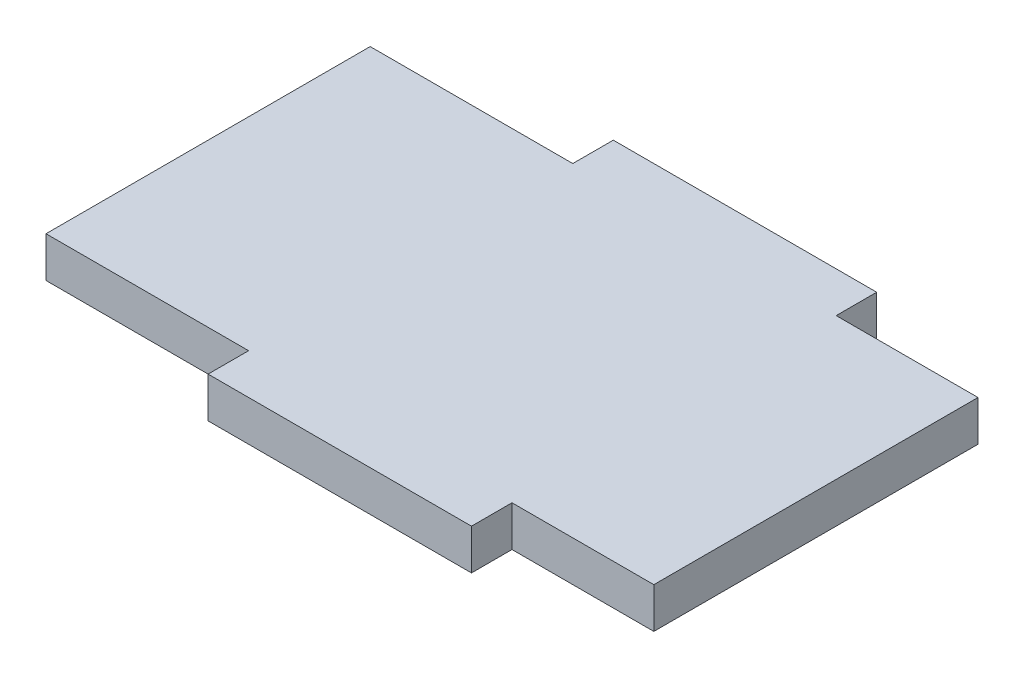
from build123d import *

# Parameters (mm, degrees)
SKETCH1_W           = 30
SKETCH1_H           = 2
BOSS_EXTRUDE1_DEPTH = 16
SKETCH2_W           = 13
SKETCH2_H           = 2
BOSS_EXTRUDE2_DEPTH = 2
SKETCH3_W           = 13
SKETCH3_H           = 2
BOSS_EXTRUDE3_DEPTH = 2


with BuildPart() as part:
    # Sketch1 → Boss-Extrude1 (new body)
    with BuildSketch(Plane.XY):
        with Locations((-8.5, -22.25)):
            Rectangle(SKETCH1_W, SKETCH1_H)
    extrude(amount=BOSS_EXTRUDE1_DEPTH)

    # Sketch2 → Boss-Extrude2 (add)
    with BuildSketch(Plane(origin=(0, 0, 0), x_dir=(-1, 0, 0), z_dir=(0, 0, -1))):
        with Locations((7, -22.25)):
            Rectangle(SKETCH2_W, SKETCH2_H)
    extrude(amount=BOSS_EXTRUDE2_DEPTH)

    # Sketch3 → Boss-Extrude3 (add)
    with BuildSketch(Plane.XY.offset(16)):
        with Locations((-7, -22.25)):
            Rectangle(SKETCH3_W, SKETCH3_H)
    extrude(amount=BOSS_EXTRUDE3_DEPTH)


solid = part.part
